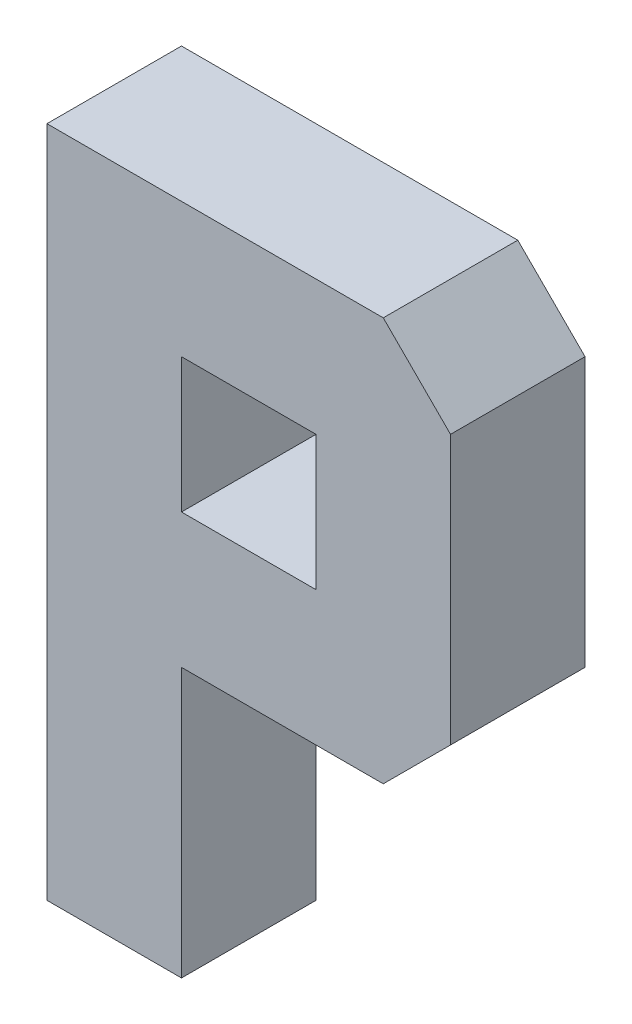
ISO-10303-21;
HEADER;
FILE_DESCRIPTION(('STEP AP214'),'2;1');
FILE_NAME('part.step','',(''),(''),'','','');
FILE_SCHEMA(('AUTOMOTIVE_DESIGN { 1 0 10303 214 1 1 1 1 }'));
ENDSEC;
DATA;
#1=APPLICATION_CONTEXT('core data for automotive mechanical design processes');
#2=APPLICATION_PROTOCOL_DEFINITION('international standard','automotive_design',2000,#1);
#3=PRODUCT_CONTEXT('',#1,'mechanical');
#4=PRODUCT('Part','Part','',(#3));
#5=PRODUCT_RELATED_PRODUCT_CATEGORY('part','',(#4));
#6=PRODUCT_DEFINITION_FORMATION('','',#4);
#7=PRODUCT_DEFINITION_CONTEXT('part definition',#1,'design');
#8=PRODUCT_DEFINITION('design','',#6,#7);
#9=PRODUCT_DEFINITION_SHAPE('','',#8);
#10=(LENGTH_UNIT() NAMED_UNIT(*) SI_UNIT(.MILLI.,.METRE.));
#11=(NAMED_UNIT(*) PLANE_ANGLE_UNIT() SI_UNIT($,.RADIAN.));
#12=(NAMED_UNIT(*) SI_UNIT($,.STERADIAN.) SOLID_ANGLE_UNIT());
#13=UNCERTAINTY_MEASURE_WITH_UNIT(LENGTH_MEASURE(1.E-05),#10,'distance_accuracy_value','');
#14=(GEOMETRIC_REPRESENTATION_CONTEXT(3) GLOBAL_UNCERTAINTY_ASSIGNED_CONTEXT((#13)) GLOBAL_UNIT_ASSIGNED_CONTEXT((#10,
#11,#12)) REPRESENTATION_CONTEXT('',''));
#15=CARTESIAN_POINT('',(0.,0.,0.));
#16=DIRECTION('',(0.,0.,1.));
#17=DIRECTION('',(1.,0.,0.));
#18=AXIS2_PLACEMENT_3D('',#15,#16,#17);
#19=CARTESIAN_POINT('',(0.,0.,10.));
#20=DIRECTION('',(0.,0.,-1.));
#21=DIRECTION('',(-1.,0.,0.));
#22=AXIS2_PLACEMENT_3D('',#19,#20,#21);
#23=PLANE('',#22);
#24=DIRECTION('',(1.,0.,0.));
#25=VECTOR('',#24,1.);
#26=CARTESIAN_POINT('',(10.,20.,10.));
#27=LINE('',#26,#25);
#28=CARTESIAN_POINT('',(10.,20.,10.));
#29=VERTEX_POINT('',#28);
#30=CARTESIAN_POINT('',(25.,20.,10.));
#31=VERTEX_POINT('',#30);
#32=EDGE_CURVE('E175',#29,#31,#27,.T.);
#33=ORIENTED_EDGE('',*,*,#32,.T.);
#34=DIRECTION('',(-0.707106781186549,-0.707106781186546,0.));
#35=VECTOR('',#34,1.);
#36=CARTESIAN_POINT('',(30.,25.,10.));
#37=LINE('',#36,#35);
#38=CARTESIAN_POINT('',(30.,25.,10.));
#39=VERTEX_POINT('',#38);
#40=EDGE_CURVE('E41',#31,#39,#37,.F.);
#41=ORIENTED_EDGE('',*,*,#40,.T.);
#42=DIRECTION('',(0.,1.,0.));
#43=VECTOR('',#42,1.);
#44=CARTESIAN_POINT('',(30.,50.,10.));
#45=LINE('',#44,#43);
#46=CARTESIAN_POINT('',(30.,45.,10.));
#47=VERTEX_POINT('',#46);
#48=EDGE_CURVE('E177',#39,#47,#45,.T.);
#49=ORIENTED_EDGE('',*,*,#48,.T.);
#50=DIRECTION('',(0.707106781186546,-0.707106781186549,0.));
#51=VECTOR('',#50,1.);
#52=CARTESIAN_POINT('',(25.,50.,10.));
#53=LINE('',#52,#51);
#54=CARTESIAN_POINT('',(25.,50.,10.));
#55=VERTEX_POINT('',#54);
#56=EDGE_CURVE('E48',#47,#55,#53,.F.);
#57=ORIENTED_EDGE('',*,*,#56,.T.);
#58=DIRECTION('',(-1.,0.,0.));
#59=VECTOR('',#58,1.);
#60=CARTESIAN_POINT('',(10.,50.,10.));
#61=LINE('',#60,#59);
#62=CARTESIAN_POINT('',(0.,50.,10.));
#63=VERTEX_POINT('',#62);
#64=EDGE_CURVE('E179',#55,#63,#61,.T.);
#65=ORIENTED_EDGE('',*,*,#64,.T.);
#66=DIRECTION('',(0.,-1.,0.));
#67=VECTOR('',#66,1.);
#68=CARTESIAN_POINT('',(0.,0.,10.));
#69=LINE('',#68,#67);
#70=CARTESIAN_POINT('',(0.,0.,10.));
#71=VERTEX_POINT('',#70);
#72=EDGE_CURVE('E167',#63,#71,#69,.T.);
#73=ORIENTED_EDGE('',*,*,#72,.T.);
#74=DIRECTION('',(1.,0.,0.));
#75=VECTOR('',#74,1.);
#76=CARTESIAN_POINT('',(0.,0.,10.));
#77=LINE('',#76,#75);
#78=CARTESIAN_POINT('',(10.,0.,10.));
#79=VERTEX_POINT('',#78);
#80=EDGE_CURVE('E170',#71,#79,#77,.T.);
#81=ORIENTED_EDGE('',*,*,#80,.T.);
#82=DIRECTION('',(0.,1.,0.));
#83=VECTOR('',#82,1.);
#84=CARTESIAN_POINT('',(10.,0.,10.));
#85=LINE('',#84,#83);
#86=EDGE_CURVE('E173',#79,#29,#85,.T.);
#87=ORIENTED_EDGE('',*,*,#86,.T.);
#88=EDGE_LOOP('',(#33,#41,#49,#57,#65,#73,#81,#87));
#89=FACE_BOUND('',#88,.T.);
#90=DIRECTION('',(0.,-1.,0.));
#91=VECTOR('',#90,1.);
#92=CARTESIAN_POINT('',(10.,40.,10.));
#93=LINE('',#92,#91);
#94=CARTESIAN_POINT('',(10.,40.,10.));
#95=VERTEX_POINT('',#94);
#96=CARTESIAN_POINT('',(10.,30.,10.));
#97=VERTEX_POINT('',#96);
#98=EDGE_CURVE('E126',#95,#97,#93,.T.);
#99=ORIENTED_EDGE('',*,*,#98,.F.);
#100=DIRECTION('',(-1.,0.,0.));
#101=VECTOR('',#100,1.);
#102=CARTESIAN_POINT('',(10.,40.,10.));
#103=LINE('',#102,#101);
#104=CARTESIAN_POINT('',(20.,40.,10.));
#105=VERTEX_POINT('',#104);
#106=EDGE_CURVE('E151',#105,#95,#103,.T.);
#107=ORIENTED_EDGE('',*,*,#106,.F.);
#108=DIRECTION('',(0.,1.,0.));
#109=VECTOR('',#108,1.);
#110=CARTESIAN_POINT('',(20.,40.,10.));
#111=LINE('',#110,#109);
#112=CARTESIAN_POINT('',(20.,30.,10.));
#113=VERTEX_POINT('',#112);
#114=EDGE_CURVE('E149',#113,#105,#111,.T.);
#115=ORIENTED_EDGE('',*,*,#114,.F.);
#116=DIRECTION('',(1.,0.,0.));
#117=VECTOR('',#116,1.);
#118=CARTESIAN_POINT('',(10.,30.,10.));
#119=LINE('',#118,#117);
#120=EDGE_CURVE('E136',#97,#113,#119,.T.);
#121=ORIENTED_EDGE('',*,*,#120,.F.);
#122=EDGE_LOOP('',(#99,#107,#115,#121));
#123=FACE_BOUND('',#122,.T.);
#124=ADVANCED_FACE('F33',(#89,#123),#23,.F.);
#125=CARTESIAN_POINT('',(0.,0.,0.));
#126=DIRECTION('',(0.,0.,-1.));
#127=DIRECTION('',(-1.,0.,0.));
#128=AXIS2_PLACEMENT_3D('',#125,#126,#127);
#129=PLANE('',#128);
#130=DIRECTION('',(0.,1.,0.));
#131=VECTOR('',#130,1.);
#132=CARTESIAN_POINT('',(30.,50.,0.));
#133=LINE('',#132,#131);
#134=CARTESIAN_POINT('',(30.,25.,0.));
#135=VERTEX_POINT('',#134);
#136=CARTESIAN_POINT('',(30.,45.,0.));
#137=VERTEX_POINT('',#136);
#138=EDGE_CURVE('E190',#135,#137,#133,.T.);
#139=ORIENTED_EDGE('',*,*,#138,.F.);
#140=DIRECTION('',(0.707106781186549,0.707106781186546,0.));
#141=VECTOR('',#140,1.);
#142=CARTESIAN_POINT('',(2.49999999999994,-2.49999999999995,0.));
#143=LINE('',#142,#141);
#144=CARTESIAN_POINT('',(25.,20.,0.));
#145=VERTEX_POINT('',#144);
#146=EDGE_CURVE('E212',#135,#145,#143,.F.);
#147=ORIENTED_EDGE('',*,*,#146,.T.);
#148=DIRECTION('',(1.,0.,0.));
#149=VECTOR('',#148,1.);
#150=CARTESIAN_POINT('',(10.,20.,0.));
#151=LINE('',#150,#149);
#152=CARTESIAN_POINT('',(10.,20.,0.));
#153=VERTEX_POINT('',#152);
#154=EDGE_CURVE('E188',#153,#145,#151,.T.);
#155=ORIENTED_EDGE('',*,*,#154,.F.);
#156=DIRECTION('',(0.,1.,0.));
#157=VECTOR('',#156,1.);
#158=CARTESIAN_POINT('',(10.,0.,0.));
#159=LINE('',#158,#157);
#160=CARTESIAN_POINT('',(10.,0.,0.));
#161=VERTEX_POINT('',#160);
#162=EDGE_CURVE('E186',#161,#153,#159,.T.);
#163=ORIENTED_EDGE('',*,*,#162,.F.);
#164=DIRECTION('',(1.,0.,0.));
#165=VECTOR('',#164,1.);
#166=CARTESIAN_POINT('',(0.,0.,0.));
#167=LINE('',#166,#165);
#168=CARTESIAN_POINT('',(0.,0.,0.));
#169=VERTEX_POINT('',#168);
#170=EDGE_CURVE('E184',#169,#161,#167,.T.);
#171=ORIENTED_EDGE('',*,*,#170,.F.);
#172=DIRECTION('',(0.,-1.,0.));
#173=VECTOR('',#172,1.);
#174=CARTESIAN_POINT('',(0.,0.,0.));
#175=LINE('',#174,#173);
#176=CARTESIAN_POINT('',(0.,50.,0.));
#177=VERTEX_POINT('',#176);
#178=EDGE_CURVE('E144',#177,#169,#175,.T.);
#179=ORIENTED_EDGE('',*,*,#178,.F.);
#180=DIRECTION('',(-1.,0.,0.));
#181=VECTOR('',#180,1.);
#182=CARTESIAN_POINT('',(0.,50.,0.));
#183=LINE('',#182,#181);
#184=CARTESIAN_POINT('',(25.,50.,0.));
#185=VERTEX_POINT('',#184);
#186=EDGE_CURVE('E171',#185,#177,#183,.T.);
#187=ORIENTED_EDGE('',*,*,#186,.F.);
#188=DIRECTION('',(-0.707106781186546,0.707106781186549,0.));
#189=VECTOR('',#188,1.);
#190=CARTESIAN_POINT('',(37.5000000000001,37.4999999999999,0.));
#191=LINE('',#190,#189);
#192=EDGE_CURVE('E210',#185,#137,#191,.F.);
#193=ORIENTED_EDGE('',*,*,#192,.T.);
#194=EDGE_LOOP('',(#139,#147,#155,#163,#171,#179,#187,#193));
#195=FACE_BOUND('',#194,.T.);
#196=DIRECTION('',(-1.,0.,0.));
#197=VECTOR('',#196,1.);
#198=CARTESIAN_POINT('',(10.,40.,0.));
#199=LINE('',#198,#197);
#200=CARTESIAN_POINT('',(20.,40.,0.));
#201=VERTEX_POINT('',#200);
#202=CARTESIAN_POINT('',(10.,40.,0.));
#203=VERTEX_POINT('',#202);
#204=EDGE_CURVE('E137',#201,#203,#199,.T.);
#205=ORIENTED_EDGE('',*,*,#204,.T.);
#206=DIRECTION('',(0.,-1.,0.));
#207=VECTOR('',#206,1.);
#208=CARTESIAN_POINT('',(10.,40.,0.));
#209=LINE('',#208,#207);
#210=CARTESIAN_POINT('',(10.,30.,0.));
#211=VERTEX_POINT('',#210);
#212=EDGE_CURVE('E155',#203,#211,#209,.T.);
#213=ORIENTED_EDGE('',*,*,#212,.T.);
#214=DIRECTION('',(1.,0.,0.));
#215=VECTOR('',#214,1.);
#216=CARTESIAN_POINT('',(10.,30.,0.));
#217=LINE('',#216,#215);
#218=CARTESIAN_POINT('',(20.,30.,0.));
#219=VERTEX_POINT('',#218);
#220=EDGE_CURVE('E143',#211,#219,#217,.T.);
#221=ORIENTED_EDGE('',*,*,#220,.T.);
#222=DIRECTION('',(0.,1.,0.));
#223=VECTOR('',#222,1.);
#224=CARTESIAN_POINT('',(20.,40.,0.));
#225=LINE('',#224,#223);
#226=EDGE_CURVE('E158',#219,#201,#225,.T.);
#227=ORIENTED_EDGE('',*,*,#226,.T.);
#228=EDGE_LOOP('',(#205,#213,#221,#227));
#229=FACE_BOUND('',#228,.T.);
#230=ADVANCED_FACE('F226',(#195,#229),#129,.T.);
#231=CARTESIAN_POINT('',(0.,0.,10.));
#232=DIRECTION('',(1.,0.,0.));
#233=DIRECTION('',(0.,0.,-1.));
#234=AXIS2_PLACEMENT_3D('',#231,#232,#233);
#235=PLANE('',#234);
#236=ORIENTED_EDGE('',*,*,#178,.T.);
#237=DIRECTION('',(0.,0.,-1.));
#238=VECTOR('',#237,1.);
#239=CARTESIAN_POINT('',(0.,0.,10.));
#240=LINE('',#239,#238);
#241=EDGE_CURVE('E202',#71,#169,#240,.T.);
#242=ORIENTED_EDGE('',*,*,#241,.F.);
#243=ORIENTED_EDGE('',*,*,#72,.F.);
#244=DIRECTION('',(0.,0.,-1.));
#245=VECTOR('',#244,1.);
#246=CARTESIAN_POINT('',(0.,50.,10.));
#247=LINE('',#246,#245);
#248=EDGE_CURVE('E181',#63,#177,#247,.T.);
#249=ORIENTED_EDGE('',*,*,#248,.T.);
#250=EDGE_LOOP('',(#236,#242,#243,#249));
#251=FACE_BOUND('',#250,.T.);
#252=ADVANCED_FACE('F242',(#251),#235,.F.);
#253=CARTESIAN_POINT('',(0.,0.,10.));
#254=DIRECTION('',(0.,1.,0.));
#255=DIRECTION('',(0.,0.,1.));
#256=AXIS2_PLACEMENT_3D('',#253,#254,#255);
#257=PLANE('',#256);
#258=ORIENTED_EDGE('',*,*,#170,.T.);
#259=DIRECTION('',(0.,0.,-1.));
#260=VECTOR('',#259,1.);
#261=CARTESIAN_POINT('',(10.,0.,10.));
#262=LINE('',#261,#260);
#263=EDGE_CURVE('E199',#79,#161,#262,.T.);
#264=ORIENTED_EDGE('',*,*,#263,.F.);
#265=ORIENTED_EDGE('',*,*,#80,.F.);
#266=ORIENTED_EDGE('',*,*,#241,.T.);
#267=EDGE_LOOP('',(#258,#264,#265,#266));
#268=FACE_BOUND('',#267,.T.);
#269=ADVANCED_FACE('F239',(#268),#257,.F.);
#270=CARTESIAN_POINT('',(10.,0.,10.));
#271=DIRECTION('',(-1.,0.,0.));
#272=DIRECTION('',(0.,-1.,0.));
#273=AXIS2_PLACEMENT_3D('',#270,#271,#272);
#274=PLANE('',#273);
#275=ORIENTED_EDGE('',*,*,#162,.T.);
#276=DIRECTION('',(0.,0.,-1.));
#277=VECTOR('',#276,1.);
#278=CARTESIAN_POINT('',(10.,20.,10.));
#279=LINE('',#278,#277);
#280=EDGE_CURVE('E196',#29,#153,#279,.T.);
#281=ORIENTED_EDGE('',*,*,#280,.F.);
#282=ORIENTED_EDGE('',*,*,#86,.F.);
#283=ORIENTED_EDGE('',*,*,#263,.T.);
#284=EDGE_LOOP('',(#275,#281,#282,#283));
#285=FACE_BOUND('',#284,.T.);
#286=ADVANCED_FACE('F233',(#285),#274,.F.);
#287=CARTESIAN_POINT('',(10.,20.,10.));
#288=DIRECTION('',(0.,1.,0.));
#289=DIRECTION('',(0.,0.,1.));
#290=AXIS2_PLACEMENT_3D('',#287,#288,#289);
#291=PLANE('',#290);
#292=ORIENTED_EDGE('',*,*,#154,.T.);
#293=DIRECTION('',(0.,0.,1.));
#294=VECTOR('',#293,1.);
#295=CARTESIAN_POINT('',(25.,20.,10.));
#296=LINE('',#295,#294);
#297=EDGE_CURVE('E56',#145,#31,#296,.T.);
#298=ORIENTED_EDGE('',*,*,#297,.T.);
#299=ORIENTED_EDGE('',*,*,#32,.F.);
#300=ORIENTED_EDGE('',*,*,#280,.T.);
#301=EDGE_LOOP('',(#292,#298,#299,#300));
#302=FACE_BOUND('',#301,.T.);
#303=ADVANCED_FACE('F229',(#302),#291,.F.);
#304=CARTESIAN_POINT('',(30.,50.,10.));
#305=DIRECTION('',(-1.,0.,0.));
#306=DIRECTION('',(0.,0.,1.));
#307=AXIS2_PLACEMENT_3D('',#304,#305,#306);
#308=PLANE('',#307);
#309=ORIENTED_EDGE('',*,*,#48,.F.);
#310=DIRECTION('',(0.,0.,-1.));
#311=VECTOR('',#310,1.);
#312=CARTESIAN_POINT('',(30.,25.,10.));
#313=LINE('',#312,#311);
#314=EDGE_CURVE('E207',#39,#135,#313,.T.);
#315=ORIENTED_EDGE('',*,*,#314,.T.);
#316=ORIENTED_EDGE('',*,*,#138,.T.);
#317=DIRECTION('',(0.,0.,1.));
#318=VECTOR('',#317,1.);
#319=CARTESIAN_POINT('',(30.,45.,10.));
#320=LINE('',#319,#318);
#321=EDGE_CURVE('E205',#137,#47,#320,.T.);
#322=ORIENTED_EDGE('',*,*,#321,.T.);
#323=EDGE_LOOP('',(#309,#315,#316,#322));
#324=FACE_BOUND('',#323,.T.);
#325=ADVANCED_FACE('F220',(#324),#308,.F.);
#326=CARTESIAN_POINT('',(0.,50.,10.));
#327=DIRECTION('',(0.,-1.,0.));
#328=DIRECTION('',(0.,0.,-1.));
#329=AXIS2_PLACEMENT_3D('',#326,#327,#328);
#330=PLANE('',#329);
#331=ORIENTED_EDGE('',*,*,#64,.F.);
#332=DIRECTION('',(0.,0.,-1.));
#333=VECTOR('',#332,1.);
#334=CARTESIAN_POINT('',(25.,50.,10.));
#335=LINE('',#334,#333);
#336=EDGE_CURVE('E11',#55,#185,#335,.T.);
#337=ORIENTED_EDGE('',*,*,#336,.T.);
#338=ORIENTED_EDGE('',*,*,#186,.T.);
#339=ORIENTED_EDGE('',*,*,#248,.F.);
#340=EDGE_LOOP('',(#331,#337,#338,#339));
#341=FACE_BOUND('',#340,.T.);
#342=ADVANCED_FACE('F245',(#341),#330,.F.);
#343=CARTESIAN_POINT('',(10.,40.,10.));
#344=DIRECTION('',(1.,0.,0.));
#345=DIRECTION('',(0.,1.,0.));
#346=AXIS2_PLACEMENT_3D('',#343,#344,#345);
#347=PLANE('',#346);
#348=ORIENTED_EDGE('',*,*,#212,.F.);
#349=DIRECTION('',(0.,0.,-1.));
#350=VECTOR('',#349,1.);
#351=CARTESIAN_POINT('',(10.,40.,10.));
#352=LINE('',#351,#350);
#353=EDGE_CURVE('E132',#95,#203,#352,.T.);
#354=ORIENTED_EDGE('',*,*,#353,.F.);
#355=ORIENTED_EDGE('',*,*,#98,.T.);
#356=DIRECTION('',(0.,0.,-1.));
#357=VECTOR('',#356,1.);
#358=CARTESIAN_POINT('',(10.,30.,10.));
#359=LINE('',#358,#357);
#360=EDGE_CURVE('E129',#97,#211,#359,.T.);
#361=ORIENTED_EDGE('',*,*,#360,.T.);
#362=EDGE_LOOP('',(#348,#354,#355,#361));
#363=FACE_BOUND('',#362,.T.);
#364=ADVANCED_FACE('F128',(#363),#347,.T.);
#365=CARTESIAN_POINT('',(10.,30.,10.));
#366=DIRECTION('',(0.,1.,0.));
#367=DIRECTION('',(0.,0.,1.));
#368=AXIS2_PLACEMENT_3D('',#365,#366,#367);
#369=PLANE('',#368);
#370=ORIENTED_EDGE('',*,*,#220,.F.);
#371=ORIENTED_EDGE('',*,*,#360,.F.);
#372=ORIENTED_EDGE('',*,*,#120,.T.);
#373=DIRECTION('',(0.,0.,-1.));
#374=VECTOR('',#373,1.);
#375=CARTESIAN_POINT('',(20.,30.,10.));
#376=LINE('',#375,#374);
#377=EDGE_CURVE('E145',#113,#219,#376,.T.);
#378=ORIENTED_EDGE('',*,*,#377,.T.);
#379=EDGE_LOOP('',(#370,#371,#372,#378));
#380=FACE_BOUND('',#379,.T.);
#381=ADVANCED_FACE('F140',(#380),#369,.T.);
#382=CARTESIAN_POINT('',(20.,40.,10.));
#383=DIRECTION('',(-1.,0.,0.));
#384=DIRECTION('',(0.,0.,1.));
#385=AXIS2_PLACEMENT_3D('',#382,#383,#384);
#386=PLANE('',#385);
#387=ORIENTED_EDGE('',*,*,#226,.F.);
#388=ORIENTED_EDGE('',*,*,#377,.F.);
#389=ORIENTED_EDGE('',*,*,#114,.T.);
#390=DIRECTION('',(0.,0.,-1.));
#391=VECTOR('',#390,1.);
#392=CARTESIAN_POINT('',(20.,40.,10.));
#393=LINE('',#392,#391);
#394=EDGE_CURVE('E164',#105,#201,#393,.T.);
#395=ORIENTED_EDGE('',*,*,#394,.T.);
#396=EDGE_LOOP('',(#387,#388,#389,#395));
#397=FACE_BOUND('',#396,.T.);
#398=ADVANCED_FACE('F309',(#397),#386,.T.);
#399=CARTESIAN_POINT('',(10.,40.,10.));
#400=DIRECTION('',(0.,-1.,0.));
#401=DIRECTION('',(0.,0.,-1.));
#402=AXIS2_PLACEMENT_3D('',#399,#400,#401);
#403=PLANE('',#402);
#404=ORIENTED_EDGE('',*,*,#204,.F.);
#405=ORIENTED_EDGE('',*,*,#394,.F.);
#406=ORIENTED_EDGE('',*,*,#106,.T.);
#407=ORIENTED_EDGE('',*,*,#353,.T.);
#408=EDGE_LOOP('',(#404,#405,#406,#407));
#409=FACE_BOUND('',#408,.T.);
#410=ADVANCED_FACE('F252',(#409),#403,.T.);
#411=CARTESIAN_POINT('',(30.,25.,10.));
#412=DIRECTION('',(-0.707106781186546,0.707106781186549,0.));
#413=DIRECTION('',(0.,0.,-1.));
#414=AXIS2_PLACEMENT_3D('',#411,#412,#413);
#415=PLANE('',#414);
#416=ORIENTED_EDGE('',*,*,#40,.F.);
#417=ORIENTED_EDGE('',*,*,#297,.F.);
#418=ORIENTED_EDGE('',*,*,#146,.F.);
#419=ORIENTED_EDGE('',*,*,#314,.F.);
#420=EDGE_LOOP('',(#416,#417,#418,#419));
#421=FACE_BOUND('',#420,.T.);
#422=ADVANCED_FACE('F223',(#421),#415,.F.);
#423=CARTESIAN_POINT('',(25.,50.,10.));
#424=DIRECTION('',(-0.707106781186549,-0.707106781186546,0.));
#425=DIRECTION('',(0.,0.,-1.));
#426=AXIS2_PLACEMENT_3D('',#423,#424,#425);
#427=PLANE('',#426);
#428=ORIENTED_EDGE('',*,*,#56,.F.);
#429=ORIENTED_EDGE('',*,*,#321,.F.);
#430=ORIENTED_EDGE('',*,*,#192,.F.);
#431=ORIENTED_EDGE('',*,*,#336,.F.);
#432=EDGE_LOOP('',(#428,#429,#430,#431));
#433=FACE_BOUND('',#432,.T.);
#434=ADVANCED_FACE('F35',(#433),#427,.F.);
#435=CLOSED_SHELL('',(#124,#230,#252,#269,#286,#303,#325,#342,#364,#381,#398,#410,#422,#434));
#436=MANIFOLD_SOLID_BREP('B2',#435);
#437=ADVANCED_BREP_SHAPE_REPRESENTATION('',(#18,#436),#14);
#438=SHAPE_DEFINITION_REPRESENTATION(#9,#437);
ENDSEC;
END-ISO-10303-21;
